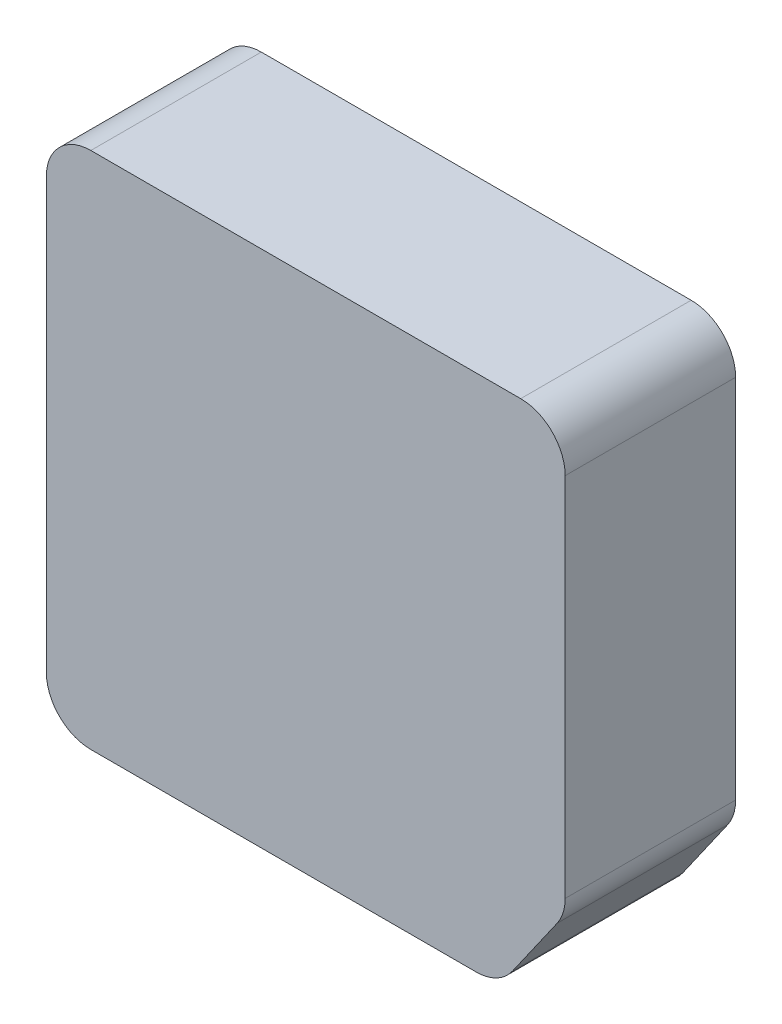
ISO-10303-21;
HEADER;
FILE_DESCRIPTION(('STEP AP214'),'2;1');
FILE_NAME('part.step','',(''),(''),'','','');
FILE_SCHEMA(('AUTOMOTIVE_DESIGN { 1 0 10303 214 1 1 1 1 }'));
ENDSEC;
DATA;
#1=APPLICATION_CONTEXT('core data for automotive mechanical design processes');
#2=APPLICATION_PROTOCOL_DEFINITION('international standard','automotive_design',2000,#1);
#3=PRODUCT_CONTEXT('',#1,'mechanical');
#4=PRODUCT('Part','Part','',(#3));
#5=PRODUCT_RELATED_PRODUCT_CATEGORY('part','',(#4));
#6=PRODUCT_DEFINITION_FORMATION('','',#4);
#7=PRODUCT_DEFINITION_CONTEXT('part definition',#1,'design');
#8=PRODUCT_DEFINITION('design','',#6,#7);
#9=PRODUCT_DEFINITION_SHAPE('','',#8);
#10=(LENGTH_UNIT() NAMED_UNIT(*) SI_UNIT(.MILLI.,.METRE.));
#11=(NAMED_UNIT(*) PLANE_ANGLE_UNIT() SI_UNIT($,.RADIAN.));
#12=(NAMED_UNIT(*) SI_UNIT($,.STERADIAN.) SOLID_ANGLE_UNIT());
#13=UNCERTAINTY_MEASURE_WITH_UNIT(LENGTH_MEASURE(1.E-05),#10,'distance_accuracy_value','');
#14=(GEOMETRIC_REPRESENTATION_CONTEXT(3) GLOBAL_UNCERTAINTY_ASSIGNED_CONTEXT((#13)) GLOBAL_UNIT_ASSIGNED_CONTEXT((#10,
#11,#12)) REPRESENTATION_CONTEXT('',''));
#15=CARTESIAN_POINT('',(0.,0.,0.));
#16=DIRECTION('',(0.,0.,1.));
#17=DIRECTION('',(1.,0.,0.));
#18=AXIS2_PLACEMENT_3D('',#15,#16,#17);
#19=CARTESIAN_POINT('',(-953.897,57.2786816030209,-29.21));
#20=DIRECTION('',(0.,0.,1.));
#21=DIRECTION('',(1.,0.,0.));
#22=AXIS2_PLACEMENT_3D('',#19,#20,#21);
#23=CYLINDRICAL_SURFACE('',#22,7.61999999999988);
#24=CARTESIAN_POINT('',(-953.897,57.2786816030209,0.));
#25=DIRECTION('',(0.,0.,1.));
#26=DIRECTION('',(1.,0.,0.));
#27=AXIS2_PLACEMENT_3D('',#24,#25,#26);
#28=CIRCLE('',#27,7.61999999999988);
#29=CARTESIAN_POINT('',(-947.655061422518,52.9080291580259,0.));
#30=VERTEX_POINT('',#29);
#31=CARTESIAN_POINT('',(-946.277,57.2786816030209,0.));
#32=VERTEX_POINT('',#31);
#33=EDGE_CURVE('E150',#30,#32,#28,.T.);
#34=ORIENTED_EDGE('',*,*,#33,.F.);
#35=DIRECTION('',(0.,0.,1.));
#36=VECTOR('',#35,1.);
#37=CARTESIAN_POINT('',(-947.655061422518,52.9080291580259,-29.21));
#38=LINE('',#37,#36);
#39=CARTESIAN_POINT('',(-947.655061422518,52.9080291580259,-29.21));
#40=VERTEX_POINT('',#39);
#41=EDGE_CURVE('E11',#40,#30,#38,.T.);
#42=ORIENTED_EDGE('',*,*,#41,.F.);
#43=CARTESIAN_POINT('',(-953.897,57.2786816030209,-29.21));
#44=DIRECTION('',(0.,0.,1.));
#45=DIRECTION('',(1.,0.,0.));
#46=AXIS2_PLACEMENT_3D('',#43,#44,#45);
#47=CIRCLE('',#46,7.61999999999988);
#48=CARTESIAN_POINT('',(-946.277,57.2786816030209,-29.21));
#49=VERTEX_POINT('',#48);
#50=EDGE_CURVE('E176',#40,#49,#47,.T.);
#51=ORIENTED_EDGE('',*,*,#50,.T.);
#52=DIRECTION('',(0.,0.,1.));
#53=VECTOR('',#52,1.);
#54=CARTESIAN_POINT('',(-946.277,57.2786816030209,-29.21));
#55=LINE('',#54,#53);
#56=EDGE_CURVE('E44',#49,#32,#55,.T.);
#57=ORIENTED_EDGE('',*,*,#56,.T.);
#58=EDGE_LOOP('',(#34,#42,#51,#57));
#59=FACE_BOUND('',#58,.T.);
#60=ADVANCED_FACE('F41',(#59),#23,.T.);
#61=CARTESIAN_POINT('',(-955.303905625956,41.984347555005,-29.21));
#62=DIRECTION('',(0.819152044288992,-0.573576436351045,0.));
#63=DIRECTION('',(0.573576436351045,0.819152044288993,0.));
#64=AXIS2_PLACEMENT_3D('',#61,#62,#63);
#65=PLANE('',#64);
#66=DIRECTION('',(0.573576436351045,0.819152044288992,0.));
#67=VECTOR('',#66,1.);
#68=CARTESIAN_POINT('',(-955.303905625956,41.984347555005,0.));
#69=LINE('',#68,#67);
#70=CARTESIAN_POINT('',(-955.303905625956,41.984347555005,0.));
#71=VERTEX_POINT('',#70);
#72=EDGE_CURVE('E174',#71,#30,#69,.T.);
#73=ORIENTED_EDGE('',*,*,#72,.F.);
#74=DIRECTION('',(0.,0.,1.));
#75=VECTOR('',#74,1.);
#76=CARTESIAN_POINT('',(-955.303905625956,41.984347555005,-29.21));
#77=LINE('',#76,#75);
#78=CARTESIAN_POINT('',(-955.303905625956,41.984347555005,-29.21));
#79=VERTEX_POINT('',#78);
#80=EDGE_CURVE('E50',#79,#71,#77,.T.);
#81=ORIENTED_EDGE('',*,*,#80,.F.);
#82=DIRECTION('',(0.573576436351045,0.819152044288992,0.));
#83=VECTOR('',#82,1.);
#84=CARTESIAN_POINT('',(-955.303905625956,41.984347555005,-29.21));
#85=LINE('',#84,#83);
#86=EDGE_CURVE('E140',#79,#40,#85,.T.);
#87=ORIENTED_EDGE('',*,*,#86,.T.);
#88=ORIENTED_EDGE('',*,*,#41,.T.);
#89=EDGE_LOOP('',(#73,#81,#87,#88));
#90=FACE_BOUND('',#89,.T.);
#91=ADVANCED_FACE('F192',(#90),#65,.T.);
#92=CARTESIAN_POINT('',(-961.545844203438,46.355,-29.21));
#93=DIRECTION('',(0.,0.,1.));
#94=DIRECTION('',(1.,0.,0.));
#95=AXIS2_PLACEMENT_3D('',#92,#93,#94);
#96=CYLINDRICAL_SURFACE('',#95,7.62);
#97=CARTESIAN_POINT('',(-961.545844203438,46.355,0.));
#98=DIRECTION('',(0.,0.,1.));
#99=DIRECTION('',(-1.,0.,0.));
#100=AXIS2_PLACEMENT_3D('',#97,#98,#99);
#101=CIRCLE('',#100,7.62);
#102=CARTESIAN_POINT('',(-961.545844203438,38.735,0.));
#103=VERTEX_POINT('',#102);
#104=EDGE_CURVE('E127',#103,#71,#101,.T.);
#105=ORIENTED_EDGE('',*,*,#104,.F.);
#106=DIRECTION('',(0.,0.,1.));
#107=VECTOR('',#106,1.);
#108=CARTESIAN_POINT('',(-961.545844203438,38.735,-29.21));
#109=LINE('',#108,#107);
#110=CARTESIAN_POINT('',(-961.545844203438,38.735,-29.21));
#111=VERTEX_POINT('',#110);
#112=EDGE_CURVE('E122',#111,#103,#109,.T.);
#113=ORIENTED_EDGE('',*,*,#112,.F.);
#114=CARTESIAN_POINT('',(-961.545844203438,46.355,-29.21));
#115=DIRECTION('',(0.,0.,1.));
#116=DIRECTION('',(-1.,0.,0.));
#117=AXIS2_PLACEMENT_3D('',#114,#115,#116);
#118=CIRCLE('',#117,7.62);
#119=EDGE_CURVE('E125',#111,#79,#118,.T.);
#120=ORIENTED_EDGE('',*,*,#119,.T.);
#121=ORIENTED_EDGE('',*,*,#80,.T.);
#122=EDGE_LOOP('',(#105,#113,#120,#121));
#123=FACE_BOUND('',#122,.T.);
#124=ADVANCED_FACE('F124',(#123),#96,.T.);
#125=CARTESIAN_POINT('',(-1027.557,38.735,-29.21));
#126=DIRECTION('',(0.,-1.,0.));
#127=DIRECTION('',(0.,0.,-1.));
#128=AXIS2_PLACEMENT_3D('',#125,#126,#127);
#129=PLANE('',#128);
#130=DIRECTION('',(1.,0.,0.));
#131=VECTOR('',#130,1.);
#132=CARTESIAN_POINT('',(-1027.557,38.735,0.));
#133=LINE('',#132,#131);
#134=CARTESIAN_POINT('',(-1027.557,38.735,0.));
#135=VERTEX_POINT('',#134);
#136=EDGE_CURVE('E171',#135,#103,#133,.T.);
#137=ORIENTED_EDGE('',*,*,#136,.F.);
#138=DIRECTION('',(0.,0.,1.));
#139=VECTOR('',#138,1.);
#140=CARTESIAN_POINT('',(-1027.557,38.735,-29.21));
#141=LINE('',#140,#139);
#142=CARTESIAN_POINT('',(-1027.557,38.735,-29.21));
#143=VERTEX_POINT('',#142);
#144=EDGE_CURVE('E132',#143,#135,#141,.T.);
#145=ORIENTED_EDGE('',*,*,#144,.F.);
#146=DIRECTION('',(1.,0.,0.));
#147=VECTOR('',#146,1.);
#148=CARTESIAN_POINT('',(-1027.557,38.735,-29.21));
#149=LINE('',#148,#147);
#150=EDGE_CURVE('E138',#143,#111,#149,.T.);
#151=ORIENTED_EDGE('',*,*,#150,.T.);
#152=ORIENTED_EDGE('',*,*,#112,.T.);
#153=EDGE_LOOP('',(#137,#145,#151,#152));
#154=FACE_BOUND('',#153,.T.);
#155=ADVANCED_FACE('F142',(#154),#129,.T.);
#156=CARTESIAN_POINT('',(-1027.557,46.355,-29.21));
#157=DIRECTION('',(0.,0.,1.));
#158=DIRECTION('',(1.,0.,0.));
#159=AXIS2_PLACEMENT_3D('',#156,#157,#158);
#160=CYLINDRICAL_SURFACE('',#159,7.61999999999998);
#161=CARTESIAN_POINT('',(-1027.557,46.355,0.));
#162=DIRECTION('',(0.,0.,1.));
#163=DIRECTION('',(1.,0.,0.));
#164=AXIS2_PLACEMENT_3D('',#161,#162,#163);
#165=CIRCLE('',#164,7.61999999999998);
#166=CARTESIAN_POINT('',(-1035.177,46.355,0.));
#167=VERTEX_POINT('',#166);
#168=EDGE_CURVE('E168',#167,#135,#165,.T.);
#169=ORIENTED_EDGE('',*,*,#168,.F.);
#170=DIRECTION('',(0.,0.,1.));
#171=VECTOR('',#170,1.);
#172=CARTESIAN_POINT('',(-1035.177,46.355,-29.21));
#173=LINE('',#172,#171);
#174=CARTESIAN_POINT('',(-1035.177,46.355,-29.21));
#175=VERTEX_POINT('',#174);
#176=EDGE_CURVE('E180',#175,#167,#173,.T.);
#177=ORIENTED_EDGE('',*,*,#176,.F.);
#178=CARTESIAN_POINT('',(-1027.557,46.355,-29.21));
#179=DIRECTION('',(0.,0.,1.));
#180=DIRECTION('',(1.,0.,0.));
#181=AXIS2_PLACEMENT_3D('',#178,#179,#180);
#182=CIRCLE('',#181,7.61999999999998);
#183=EDGE_CURVE('E143',#175,#143,#182,.T.);
#184=ORIENTED_EDGE('',*,*,#183,.T.);
#185=ORIENTED_EDGE('',*,*,#144,.T.);
#186=EDGE_LOOP('',(#169,#177,#184,#185));
#187=FACE_BOUND('',#186,.T.);
#188=ADVANCED_FACE('F205',(#187),#160,.T.);
#189=CARTESIAN_POINT('',(-1035.177,120.015,-29.21));
#190=DIRECTION('',(-1.,0.,0.));
#191=DIRECTION('',(0.,0.,1.));
#192=AXIS2_PLACEMENT_3D('',#189,#190,#191);
#193=PLANE('',#192);
#194=DIRECTION('',(0.,-1.,0.));
#195=VECTOR('',#194,1.);
#196=CARTESIAN_POINT('',(-1035.177,120.015,0.));
#197=LINE('',#196,#195);
#198=CARTESIAN_POINT('',(-1035.177,120.015,0.));
#199=VERTEX_POINT('',#198);
#200=EDGE_CURVE('E165',#199,#167,#197,.T.);
#201=ORIENTED_EDGE('',*,*,#200,.F.);
#202=DIRECTION('',(0.,0.,1.));
#203=VECTOR('',#202,1.);
#204=CARTESIAN_POINT('',(-1035.177,120.015,-29.21));
#205=LINE('',#204,#203);
#206=CARTESIAN_POINT('',(-1035.177,120.015,-29.21));
#207=VERTEX_POINT('',#206);
#208=EDGE_CURVE('E182',#207,#199,#205,.T.);
#209=ORIENTED_EDGE('',*,*,#208,.F.);
#210=DIRECTION('',(0.,-1.,0.));
#211=VECTOR('',#210,1.);
#212=CARTESIAN_POINT('',(-1035.177,120.015,-29.21));
#213=LINE('',#212,#211);
#214=EDGE_CURVE('E145',#207,#175,#213,.T.);
#215=ORIENTED_EDGE('',*,*,#214,.T.);
#216=ORIENTED_EDGE('',*,*,#176,.T.);
#217=EDGE_LOOP('',(#201,#209,#215,#216));
#218=FACE_BOUND('',#217,.T.);
#219=ADVANCED_FACE('F208',(#218),#193,.T.);
#220=CARTESIAN_POINT('',(-1027.557,120.015,-29.21));
#221=DIRECTION('',(0.,0.,1.));
#222=DIRECTION('',(1.,0.,0.));
#223=AXIS2_PLACEMENT_3D('',#220,#221,#222);
#224=CYLINDRICAL_SURFACE('',#223,7.61999999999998);
#225=CARTESIAN_POINT('',(-1027.557,120.015,0.));
#226=DIRECTION('',(0.,0.,1.));
#227=DIRECTION('',(1.,0.,0.));
#228=AXIS2_PLACEMENT_3D('',#225,#226,#227);
#229=CIRCLE('',#228,7.61999999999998);
#230=CARTESIAN_POINT('',(-1027.557,127.635,0.));
#231=VERTEX_POINT('',#230);
#232=EDGE_CURVE('E162',#231,#199,#229,.T.);
#233=ORIENTED_EDGE('',*,*,#232,.F.);
#234=DIRECTION('',(0.,0.,1.));
#235=VECTOR('',#234,1.);
#236=CARTESIAN_POINT('',(-1027.557,127.635,-29.21));
#237=LINE('',#236,#235);
#238=CARTESIAN_POINT('',(-1027.557,127.635,-29.21));
#239=VERTEX_POINT('',#238);
#240=EDGE_CURVE('E184',#239,#231,#237,.T.);
#241=ORIENTED_EDGE('',*,*,#240,.F.);
#242=CARTESIAN_POINT('',(-1027.557,120.015,-29.21));
#243=DIRECTION('',(0.,0.,1.));
#244=DIRECTION('',(1.,0.,0.));
#245=AXIS2_PLACEMENT_3D('',#242,#243,#244);
#246=CIRCLE('',#245,7.61999999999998);
#247=EDGE_CURVE('E307',#239,#207,#246,.T.);
#248=ORIENTED_EDGE('',*,*,#247,.T.);
#249=ORIENTED_EDGE('',*,*,#208,.T.);
#250=EDGE_LOOP('',(#233,#241,#248,#249));
#251=FACE_BOUND('',#250,.T.);
#252=ADVANCED_FACE('F212',(#251),#224,.T.);
#253=CARTESIAN_POINT('',(-1027.557,127.635,-29.21));
#254=DIRECTION('',(0.,1.,0.));
#255=DIRECTION('',(0.,0.,1.));
#256=AXIS2_PLACEMENT_3D('',#253,#254,#255);
#257=PLANE('',#256);
#258=DIRECTION('',(-1.,0.,0.));
#259=VECTOR('',#258,1.);
#260=CARTESIAN_POINT('',(-1027.557,127.635,0.));
#261=LINE('',#260,#259);
#262=CARTESIAN_POINT('',(-953.897,127.635,0.));
#263=VERTEX_POINT('',#262);
#264=EDGE_CURVE('E159',#263,#231,#261,.T.);
#265=ORIENTED_EDGE('',*,*,#264,.F.);
#266=DIRECTION('',(0.,0.,1.));
#267=VECTOR('',#266,1.);
#268=CARTESIAN_POINT('',(-953.897,127.635,-29.21));
#269=LINE('',#268,#267);
#270=CARTESIAN_POINT('',(-953.897,127.635,-29.21));
#271=VERTEX_POINT('',#270);
#272=EDGE_CURVE('E186',#271,#263,#269,.T.);
#273=ORIENTED_EDGE('',*,*,#272,.F.);
#274=DIRECTION('',(-1.,0.,0.));
#275=VECTOR('',#274,1.);
#276=CARTESIAN_POINT('',(-1027.557,127.635,-29.21));
#277=LINE('',#276,#275);
#278=EDGE_CURVE('E303',#271,#239,#277,.T.);
#279=ORIENTED_EDGE('',*,*,#278,.T.);
#280=ORIENTED_EDGE('',*,*,#240,.T.);
#281=EDGE_LOOP('',(#265,#273,#279,#280));
#282=FACE_BOUND('',#281,.T.);
#283=ADVANCED_FACE('F216',(#282),#257,.T.);
#284=CARTESIAN_POINT('',(-953.897,120.015,-29.21));
#285=DIRECTION('',(0.,0.,1.));
#286=DIRECTION('',(1.,0.,0.));
#287=AXIS2_PLACEMENT_3D('',#284,#285,#286);
#288=CYLINDRICAL_SURFACE('',#287,7.61999999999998);
#289=CARTESIAN_POINT('',(-953.897,120.015,0.));
#290=DIRECTION('',(0.,0.,1.));
#291=DIRECTION('',(-1.,0.,0.));
#292=AXIS2_PLACEMENT_3D('',#289,#290,#291);
#293=CIRCLE('',#292,7.61999999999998);
#294=CARTESIAN_POINT('',(-946.277,120.015,0.));
#295=VERTEX_POINT('',#294);
#296=EDGE_CURVE('E156',#295,#263,#293,.T.);
#297=ORIENTED_EDGE('',*,*,#296,.F.);
#298=DIRECTION('',(0.,0.,1.));
#299=VECTOR('',#298,1.);
#300=CARTESIAN_POINT('',(-946.277,120.015,-29.21));
#301=LINE('',#300,#299);
#302=CARTESIAN_POINT('',(-946.277,120.015,-29.21));
#303=VERTEX_POINT('',#302);
#304=EDGE_CURVE('E187',#303,#295,#301,.T.);
#305=ORIENTED_EDGE('',*,*,#304,.F.);
#306=CARTESIAN_POINT('',(-953.897,120.015,-29.21));
#307=DIRECTION('',(0.,0.,1.));
#308=DIRECTION('',(-1.,0.,0.));
#309=AXIS2_PLACEMENT_3D('',#306,#307,#308);
#310=CIRCLE('',#309,7.61999999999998);
#311=EDGE_CURVE('E314',#303,#271,#310,.T.);
#312=ORIENTED_EDGE('',*,*,#311,.T.);
#313=ORIENTED_EDGE('',*,*,#272,.T.);
#314=EDGE_LOOP('',(#297,#305,#312,#313));
#315=FACE_BOUND('',#314,.T.);
#316=ADVANCED_FACE('F220',(#315),#288,.T.);
#317=CARTESIAN_POINT('',(-946.277,120.015,-29.21));
#318=DIRECTION('',(1.,0.,0.));
#319=DIRECTION('',(0.,1.,0.));
#320=AXIS2_PLACEMENT_3D('',#317,#318,#319);
#321=PLANE('',#320);
#322=DIRECTION('',(0.,1.,0.));
#323=VECTOR('',#322,1.);
#324=CARTESIAN_POINT('',(-946.277,120.015,0.));
#325=LINE('',#324,#323);
#326=EDGE_CURVE('E153',#32,#295,#325,.T.);
#327=ORIENTED_EDGE('',*,*,#326,.F.);
#328=ORIENTED_EDGE('',*,*,#56,.F.);
#329=DIRECTION('',(0.,1.,0.));
#330=VECTOR('',#329,1.);
#331=CARTESIAN_POINT('',(-946.277,120.015,-29.21));
#332=LINE('',#331,#330);
#333=EDGE_CURVE('E316',#49,#303,#332,.T.);
#334=ORIENTED_EDGE('',*,*,#333,.T.);
#335=ORIENTED_EDGE('',*,*,#304,.T.);
#336=EDGE_LOOP('',(#327,#328,#334,#335));
#337=FACE_BOUND('',#336,.T.);
#338=ADVANCED_FACE('F189',(#337),#321,.T.);
#339=CARTESIAN_POINT('',(-953.897,57.2786816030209,-29.21));
#340=DIRECTION('',(0.,0.,1.));
#341=DIRECTION('',(1.,0.,0.));
#342=AXIS2_PLACEMENT_3D('',#339,#340,#341);
#343=PLANE('',#342);
#344=ORIENTED_EDGE('',*,*,#50,.F.);
#345=ORIENTED_EDGE('',*,*,#86,.F.);
#346=ORIENTED_EDGE('',*,*,#119,.F.);
#347=ORIENTED_EDGE('',*,*,#150,.F.);
#348=ORIENTED_EDGE('',*,*,#183,.F.);
#349=ORIENTED_EDGE('',*,*,#214,.F.);
#350=ORIENTED_EDGE('',*,*,#247,.F.);
#351=ORIENTED_EDGE('',*,*,#278,.F.);
#352=ORIENTED_EDGE('',*,*,#311,.F.);
#353=ORIENTED_EDGE('',*,*,#333,.F.);
#354=EDGE_LOOP('',(#344,#345,#346,#347,#348,#349,#350,#351,#352,#353));
#355=FACE_BOUND('',#354,.T.);
#356=ADVANCED_FACE('F136',(#355),#343,.F.);
#357=CARTESIAN_POINT('',(-953.897,57.2786816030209,0.));
#358=DIRECTION('',(0.,0.,1.));
#359=DIRECTION('',(1.,0.,0.));
#360=AXIS2_PLACEMENT_3D('',#357,#358,#359);
#361=PLANE('',#360);
#362=ORIENTED_EDGE('',*,*,#33,.T.);
#363=ORIENTED_EDGE('',*,*,#326,.T.);
#364=ORIENTED_EDGE('',*,*,#296,.T.);
#365=ORIENTED_EDGE('',*,*,#264,.T.);
#366=ORIENTED_EDGE('',*,*,#232,.T.);
#367=ORIENTED_EDGE('',*,*,#200,.T.);
#368=ORIENTED_EDGE('',*,*,#168,.T.);
#369=ORIENTED_EDGE('',*,*,#136,.T.);
#370=ORIENTED_EDGE('',*,*,#104,.T.);
#371=ORIENTED_EDGE('',*,*,#72,.T.);
#372=EDGE_LOOP('',(#362,#363,#364,#365,#366,#367,#368,#369,#370,#371));
#373=FACE_BOUND('',#372,.T.);
#374=ADVANCED_FACE('F191',(#373),#361,.T.);
#375=CLOSED_SHELL('',(#60,#91,#124,#155,#188,#219,#252,#283,#316,#338,#356,#374));
#376=MANIFOLD_SOLID_BREP('B2',#375);
#377=ADVANCED_BREP_SHAPE_REPRESENTATION('',(#18,#376),#14);
#378=SHAPE_DEFINITION_REPRESENTATION(#9,#377);
ENDSEC;
END-ISO-10303-21;
